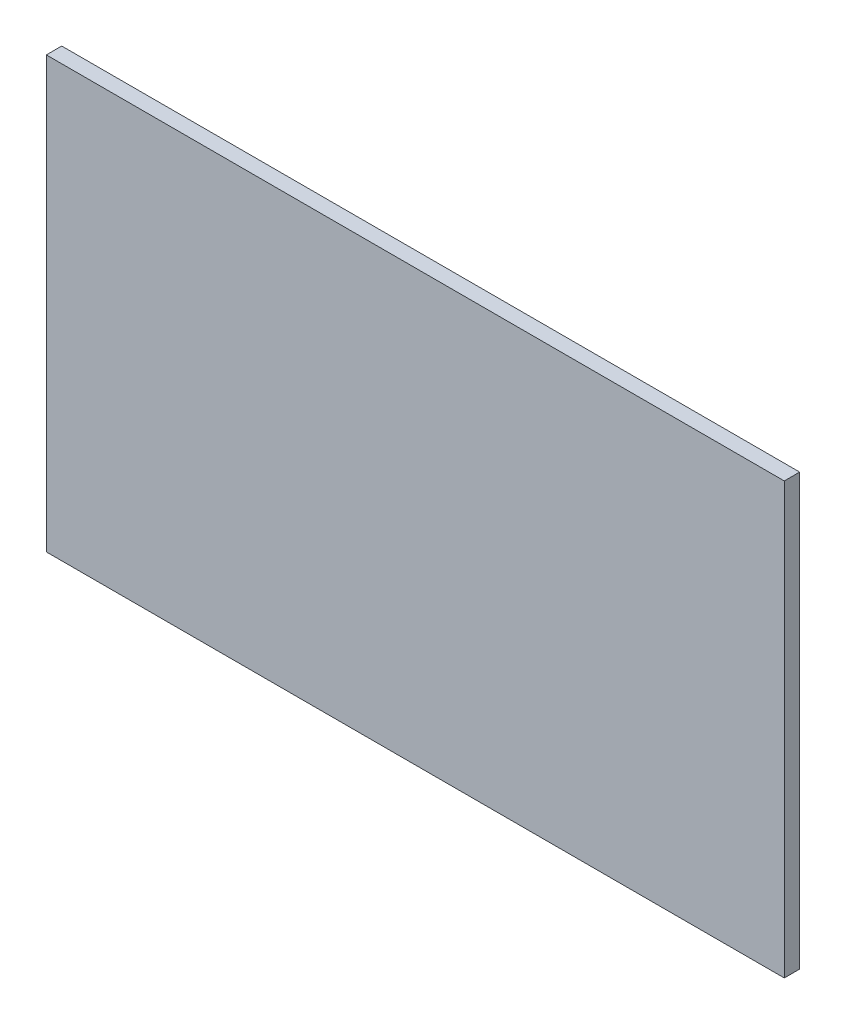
ISO-10303-21;
HEADER;
FILE_DESCRIPTION(('STEP AP214'),'2;1');
FILE_NAME('part.step','',(''),(''),'','','');
FILE_SCHEMA(('AUTOMOTIVE_DESIGN { 1 0 10303 214 1 1 1 1 }'));
ENDSEC;
DATA;
#1=APPLICATION_CONTEXT('core data for automotive mechanical design processes');
#2=APPLICATION_PROTOCOL_DEFINITION('international standard','automotive_design',2000,#1);
#3=PRODUCT_CONTEXT('',#1,'mechanical');
#4=PRODUCT('Part','Part','',(#3));
#5=PRODUCT_RELATED_PRODUCT_CATEGORY('part','',(#4));
#6=PRODUCT_DEFINITION_FORMATION('','',#4);
#7=PRODUCT_DEFINITION_CONTEXT('part definition',#1,'design');
#8=PRODUCT_DEFINITION('design','',#6,#7);
#9=PRODUCT_DEFINITION_SHAPE('','',#8);
#10=(LENGTH_UNIT() NAMED_UNIT(*) SI_UNIT(.MILLI.,.METRE.));
#11=(NAMED_UNIT(*) PLANE_ANGLE_UNIT() SI_UNIT($,.RADIAN.));
#12=(NAMED_UNIT(*) SI_UNIT($,.STERADIAN.) SOLID_ANGLE_UNIT());
#13=UNCERTAINTY_MEASURE_WITH_UNIT(LENGTH_MEASURE(1.E-05),#10,'distance_accuracy_value','');
#14=(GEOMETRIC_REPRESENTATION_CONTEXT(3) GLOBAL_UNCERTAINTY_ASSIGNED_CONTEXT((#13)) GLOBAL_UNIT_ASSIGNED_CONTEXT((#10,
#11,#12)) REPRESENTATION_CONTEXT('',''));
#15=CARTESIAN_POINT('',(0.,0.,0.));
#16=DIRECTION('',(0.,0.,1.));
#17=DIRECTION('',(1.,0.,0.));
#18=AXIS2_PLACEMENT_3D('',#15,#16,#17);
#19=CARTESIAN_POINT('',(0.,0.,12.7));
#20=DIRECTION('',(1.,0.,0.));
#21=DIRECTION('',(0.,0.,-1.));
#22=AXIS2_PLACEMENT_3D('',#19,#20,#21);
#23=PLANE('',#22);
#24=DIRECTION('',(0.,-1.,0.));
#25=VECTOR('',#24,1.);
#26=CARTESIAN_POINT('',(0.,0.,0.));
#27=LINE('',#26,#25);
#28=CARTESIAN_POINT('',(0.,355.6,0.));
#29=VERTEX_POINT('',#28);
#30=CARTESIAN_POINT('',(0.,0.,0.));
#31=VERTEX_POINT('',#30);
#32=EDGE_CURVE('E99',#29,#31,#27,.T.);
#33=ORIENTED_EDGE('',*,*,#32,.T.);
#34=DIRECTION('',(0.,0.,-1.));
#35=VECTOR('',#34,1.);
#36=CARTESIAN_POINT('',(0.,0.,12.7));
#37=LINE('',#36,#35);
#38=CARTESIAN_POINT('',(0.,0.,12.7));
#39=VERTEX_POINT('',#38);
#40=EDGE_CURVE('E11',#39,#31,#37,.T.);
#41=ORIENTED_EDGE('',*,*,#40,.F.);
#42=DIRECTION('',(0.,-1.,0.));
#43=VECTOR('',#42,1.);
#44=CARTESIAN_POINT('',(0.,0.,12.7));
#45=LINE('',#44,#43);
#46=CARTESIAN_POINT('',(0.,355.6,12.7));
#47=VERTEX_POINT('',#46);
#48=EDGE_CURVE('E87',#47,#39,#45,.T.);
#49=ORIENTED_EDGE('',*,*,#48,.F.);
#50=DIRECTION('',(0.,0.,-1.));
#51=VECTOR('',#50,1.);
#52=CARTESIAN_POINT('',(0.,355.6,12.7));
#53=LINE('',#52,#51);
#54=EDGE_CURVE('E95',#47,#29,#53,.T.);
#55=ORIENTED_EDGE('',*,*,#54,.T.);
#56=EDGE_LOOP('',(#33,#41,#49,#55));
#57=FACE_BOUND('',#56,.T.);
#58=ADVANCED_FACE('F36',(#57),#23,.F.);
#59=CARTESIAN_POINT('',(0.,0.,12.7));
#60=DIRECTION('',(0.,1.,0.));
#61=DIRECTION('',(0.,0.,1.));
#62=AXIS2_PLACEMENT_3D('',#59,#60,#61);
#63=PLANE('',#62);
#64=DIRECTION('',(1.,0.,0.));
#65=VECTOR('',#64,1.);
#66=CARTESIAN_POINT('',(0.,0.,0.));
#67=LINE('',#66,#65);
#68=CARTESIAN_POINT('',(609.6,0.,0.));
#69=VERTEX_POINT('',#68);
#70=EDGE_CURVE('E91',#31,#69,#67,.T.);
#71=ORIENTED_EDGE('',*,*,#70,.T.);
#72=DIRECTION('',(0.,0.,-1.));
#73=VECTOR('',#72,1.);
#74=CARTESIAN_POINT('',(609.6,0.,12.7));
#75=LINE('',#74,#73);
#76=CARTESIAN_POINT('',(609.6,0.,12.7));
#77=VERTEX_POINT('',#76);
#78=EDGE_CURVE('E44',#77,#69,#75,.T.);
#79=ORIENTED_EDGE('',*,*,#78,.F.);
#80=DIRECTION('',(1.,0.,0.));
#81=VECTOR('',#80,1.);
#82=CARTESIAN_POINT('',(0.,0.,12.7));
#83=LINE('',#82,#81);
#84=EDGE_CURVE('E82',#39,#77,#83,.T.);
#85=ORIENTED_EDGE('',*,*,#84,.F.);
#86=ORIENTED_EDGE('',*,*,#40,.T.);
#87=EDGE_LOOP('',(#71,#79,#85,#86));
#88=FACE_BOUND('',#87,.T.);
#89=ADVANCED_FACE('F90',(#88),#63,.F.);
#90=CARTESIAN_POINT('',(609.6,0.,12.7));
#91=DIRECTION('',(-1.,0.,0.));
#92=DIRECTION('',(0.,0.,1.));
#93=AXIS2_PLACEMENT_3D('',#90,#91,#92);
#94=PLANE('',#93);
#95=DIRECTION('',(0.,1.,0.));
#96=VECTOR('',#95,1.);
#97=CARTESIAN_POINT('',(609.6,0.,0.));
#98=LINE('',#97,#96);
#99=CARTESIAN_POINT('',(609.6,355.6,0.));
#100=VERTEX_POINT('',#99);
#101=EDGE_CURVE('E69',#69,#100,#98,.T.);
#102=ORIENTED_EDGE('',*,*,#101,.T.);
#103=DIRECTION('',(0.,0.,-1.));
#104=VECTOR('',#103,1.);
#105=CARTESIAN_POINT('',(609.6,355.6,12.7));
#106=LINE('',#105,#104);
#107=CARTESIAN_POINT('',(609.6,355.6,12.7));
#108=VERTEX_POINT('',#107);
#109=EDGE_CURVE('E92',#108,#100,#106,.T.);
#110=ORIENTED_EDGE('',*,*,#109,.F.);
#111=DIRECTION('',(0.,1.,0.));
#112=VECTOR('',#111,1.);
#113=CARTESIAN_POINT('',(609.6,0.,12.7));
#114=LINE('',#113,#112);
#115=EDGE_CURVE('E85',#77,#108,#114,.T.);
#116=ORIENTED_EDGE('',*,*,#115,.F.);
#117=ORIENTED_EDGE('',*,*,#78,.T.);
#118=EDGE_LOOP('',(#102,#110,#116,#117));
#119=FACE_BOUND('',#118,.T.);
#120=ADVANCED_FACE('F93',(#119),#94,.F.);
#121=CARTESIAN_POINT('',(0.,355.6,12.7));
#122=DIRECTION('',(0.,-1.,0.));
#123=DIRECTION('',(0.,0.,-1.));
#124=AXIS2_PLACEMENT_3D('',#121,#122,#123);
#125=PLANE('',#124);
#126=DIRECTION('',(-1.,0.,0.));
#127=VECTOR('',#126,1.);
#128=CARTESIAN_POINT('',(0.,355.6,0.));
#129=LINE('',#128,#127);
#130=EDGE_CURVE('E75',#100,#29,#129,.T.);
#131=ORIENTED_EDGE('',*,*,#130,.T.);
#132=ORIENTED_EDGE('',*,*,#54,.F.);
#133=DIRECTION('',(-1.,0.,0.));
#134=VECTOR('',#133,1.);
#135=CARTESIAN_POINT('',(0.,355.6,12.7));
#136=LINE('',#135,#134);
#137=EDGE_CURVE('E52',#108,#47,#136,.T.);
#138=ORIENTED_EDGE('',*,*,#137,.F.);
#139=ORIENTED_EDGE('',*,*,#109,.T.);
#140=EDGE_LOOP('',(#131,#132,#138,#139));
#141=FACE_BOUND('',#140,.T.);
#142=ADVANCED_FACE('F106',(#141),#125,.F.);
#143=CARTESIAN_POINT('',(0.,0.,12.7));
#144=DIRECTION('',(0.,0.,-1.));
#145=DIRECTION('',(-1.,0.,0.));
#146=AXIS2_PLACEMENT_3D('',#143,#144,#145);
#147=PLANE('',#146);
#148=ORIENTED_EDGE('',*,*,#48,.T.);
#149=ORIENTED_EDGE('',*,*,#84,.T.);
#150=ORIENTED_EDGE('',*,*,#115,.T.);
#151=ORIENTED_EDGE('',*,*,#137,.T.);
#152=EDGE_LOOP('',(#148,#149,#150,#151));
#153=FACE_BOUND('',#152,.T.);
#154=ADVANCED_FACE('F83',(#153),#147,.F.);
#155=CARTESIAN_POINT('',(0.,0.,0.));
#156=DIRECTION('',(0.,0.,-1.));
#157=DIRECTION('',(-1.,0.,0.));
#158=AXIS2_PLACEMENT_3D('',#155,#156,#157);
#159=PLANE('',#158);
#160=ORIENTED_EDGE('',*,*,#32,.F.);
#161=ORIENTED_EDGE('',*,*,#130,.F.);
#162=ORIENTED_EDGE('',*,*,#101,.F.);
#163=ORIENTED_EDGE('',*,*,#70,.F.);
#164=EDGE_LOOP('',(#160,#161,#162,#163));
#165=FACE_BOUND('',#164,.T.);
#166=ADVANCED_FACE('F109',(#165),#159,.T.);
#167=CLOSED_SHELL('',(#58,#89,#120,#142,#154,#166));
#168=MANIFOLD_SOLID_BREP('B2',#167);
#169=ADVANCED_BREP_SHAPE_REPRESENTATION('',(#18,#168),#14);
#170=SHAPE_DEFINITION_REPRESENTATION(#9,#169);
ENDSEC;
END-ISO-10303-21;
